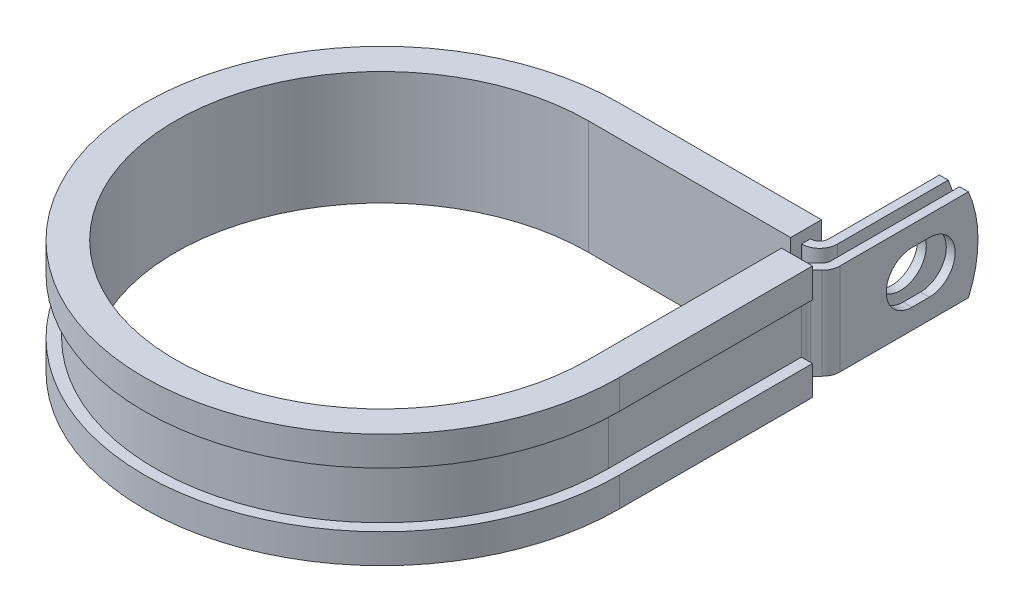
from build123d import *

# Parameters (mm, degrees)
EXTRUDE_THIN1_DEPTH = 6.35
SKETCH2_R           = 3.5687
CUT_EXTRUDE1_DEPTH  = 1.2192
CUT_EXTRUDE2_DEPTH  = 1.2192
CUT_EXTRUDE3_DEPTH  = 79.254036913


with BuildPart() as part:
    # Sketch1 → Extrude-Thin1 (new, symmetric)
    with BuildSketch(Plane(origin=(0, 0, 0), x_dir=(1, 0, 0), z_dir=(0, 1, 0))):
        with BuildLine():
            Line((31.9964698, 49.1998), (31.9964698, 30.099))
            ThreePointArc((31.9964698, 30.099), (31.903663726, 29.632432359), (31.639374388, 29.236895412))
            Line((31.639374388, 29.236895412), (30.813190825, 28.410711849))
            ThreePointArc((30.813190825, 28.410711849), (30.284612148, 27.619637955), (30.099, 26.686502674))
            Line((30.099, 26.686502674), (30.099, 0))
            ThreePointArc((30.099, 0), (-21.283207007, -21.283207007), (0, 30.099))
            Line((0, 30.099), (27.9832698, 30.099))
            ThreePointArc((27.9832698, 30.099), (29.707478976, 30.813190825), (30.4216698, 32.5374))
            Line((30.4216698, 32.5374), (30.4216698, 49.1998))
            Line((30.4216698, 49.1998), (29.2024698, 49.1998))
            Line((29.2024698, 49.1998), (29.2024698, 32.5374))
            ThreePointArc((29.2024698, 32.5374), (28.845374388, 31.675295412), (27.9832698, 31.3182))
            Line((27.9832698, 31.3182), (0, 31.3182))
            ThreePointArc((0, 31.3182), (-22.145311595, -22.145311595), (31.3182, 0))
            Line((31.3182, 0), (31.3182, 26.686502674))
            ThreePointArc((31.3182, 26.686502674), (31.411006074, 27.153070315), (31.675295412, 27.548607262))
            Line((31.675295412, 27.548607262), (32.501478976, 28.374790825))
            ThreePointArc((32.501478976, 28.374790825), (33.030057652, 29.165864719), (33.2156698, 30.099))
            Line((33.2156698, 30.099), (33.2156698, 49.1998))
            Line((33.2156698, 49.1998), (31.9964698, 49.1998))
        make_face()
    extrude(amount=EXTRUDE_THIN1_DEPTH, both=True)

    # Sketch2 → Cut-Extrude1 (cut)
    with BuildSketch(Plane.ZY.offset(-29.2024698)):
        with Locations((-41.275, 0)):
            Circle(SKETCH2_R)
    extrude(amount=-CUT_EXTRUDE1_DEPTH, mode=Mode.SUBTRACT)

    # Sketch3 → Cut-Extrude2 (cut)
    with BuildSketch(Plane(origin=(33.2156698, 0, 0), x_dir=(0, 0, -1), z_dir=(1, 0, 0))):
        with BuildLine():
            Line((40.0812, 3.5687), (42.4688, 3.5687))
            ThreePointArc((42.4688, 3.5687), (46.0375, 0), (42.4688, -3.5687))
            Line((42.4688, -3.5687), (40.0812, -3.5687))
            ThreePointArc((40.0812, -3.5687), (36.5125, 0), (40.0812, 3.5687))
        make_face()
    extrude(amount=-CUT_EXTRUDE2_DEPTH, mode=Mode.SUBTRACT)

    # Sketch4 → Cut-Extrude3 (cut, through all)
    with BuildSketch(Plane.ZY.offset(-29.2024698)):
        with BuildLine():
            Line((-47.874477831, 6.35), (-49.1998, 6.35))
            Line((-49.1998, 6.35), (-49.1998, 5.4e-08))
            ThreePointArc((-49.1998, 5.4e-08), (-48.864937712, 3.24341562), (-47.874477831, 6.35))
        make_face()
        with BuildLine():
            ThreePointArc((-47.874477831, -6.35), (-48.864937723, -3.243415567), (-49.1998, 5.4e-08))
            Line((-49.1998, 5.4e-08), (-49.1998, -6.35))
            Line((-49.1998, -6.35), (-47.874477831, -6.35))
        make_face()
    extrude(amount=-CUT_EXTRUDE3_DEPTH, mode=Mode.SUBTRACT)

    # Sweep1: sweep along a path in Sketch6
    with BuildLine(Plane(origin=(0, 6.35, 0), x_dir=(1, 0, 0), z_dir=(0, 1, 0))) as sweep1_path:
        Line((28.575, 26.686502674), (28.575, 0))
        ThreePointArc((28.575, 0), (-20.205576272, -20.205576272), (0, 28.575))
        Line((0, 28.575), (27.9324698, 28.575))
    # Sketch5 → Sweep1 (sweep)
    with BuildSketch(Plane(origin=(0, 0, -26.686502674), x_dir=(-1, 0, 0), z_dir=(0, 0, -1))):
        Polygon((-31.3182, 6.35), (-30.099, 6.35), (-30.099, -6.35), (-31.3182, -6.35), (-31.3182, -3.81), (-32.8422, -3.81), (-32.8422, -7.874), (-28.575, -7.874), (-28.575, 7.874), (-32.8422, 7.874), (-32.8422, 3.81), (-31.3182, 3.81), align=None)
    sweep(path=sweep1_path.line)


solid = part.part
